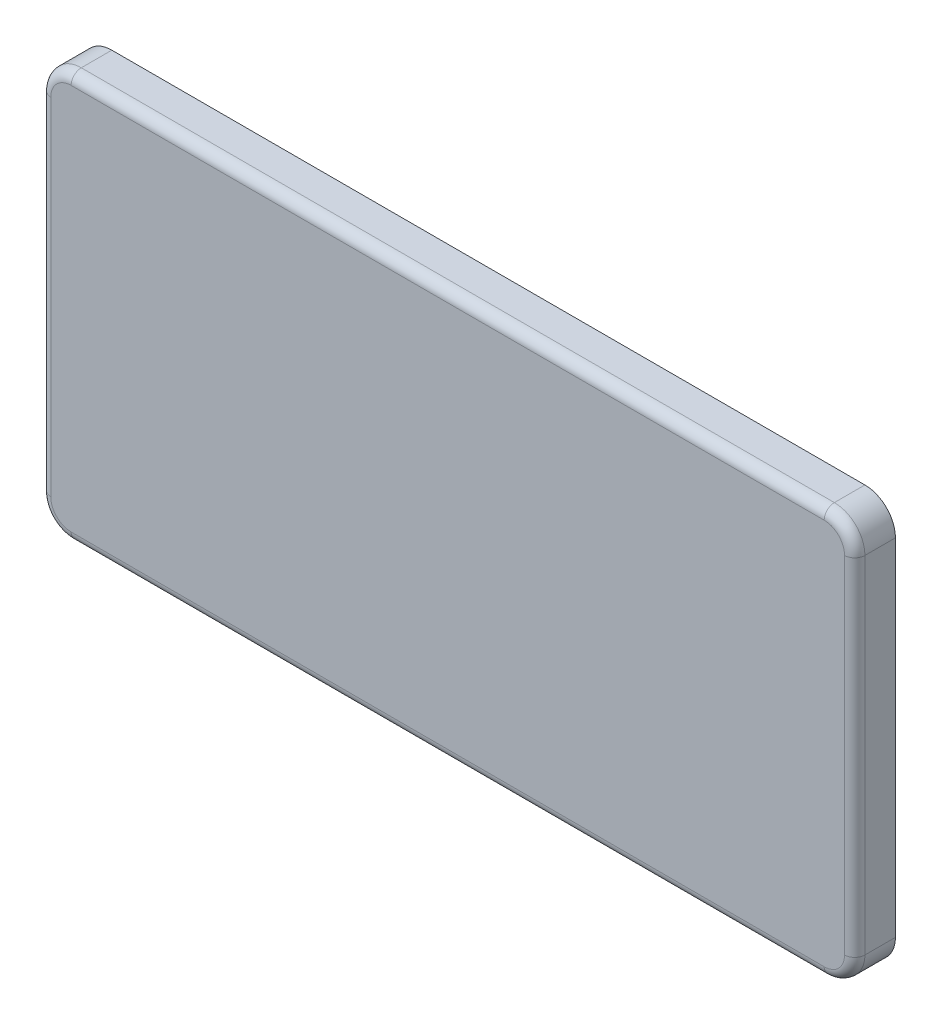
from build123d import *

# Parameters (mm, degrees)
EXTRUIR5_DEPTH = 4
REDONDEO1_R    = 1


with BuildPart() as part:
    # Croquis1 → Extruir5 (new body)
    with BuildSketch(Plane.XY):
        with BuildLine():
            Line((-17, 20), (57, 20))
            ThreePointArc((57, 20), (59.121320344, 19.121320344), (60, 17))
            Line((60, 17), (60, -17))
            ThreePointArc((60, -17), (59.121320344, -19.121320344), (57, -20))
            Line((57, -20), (-17, -20))
            ThreePointArc((-17, -20), (-19.121320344, -19.121320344), (-20, -17))
            Line((-20, -17), (-20, 17))
            ThreePointArc((-20, 17), (-19.121320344, 19.121320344), (-17, 20))
        make_face()
    extrude(amount=EXTRUIR5_DEPTH)

    # Redondeo1
    redondeo1_edges = [part.edges().sort_by_distance(p)[0] for p in [
        (59.121320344, 19.121320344, 4),
        (20, 20, 4),
        (-19.121320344, 19.121320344, 4),
        (-20, 0, 4),
        (-19.121320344, -19.121320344, 4),
        (20, -20, 4),
        (59.121320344, -19.121320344, 4),
        (60, 0, 4),
    ]]
    fillet(redondeo1_edges, radius=REDONDEO1_R)


solid = part.part
